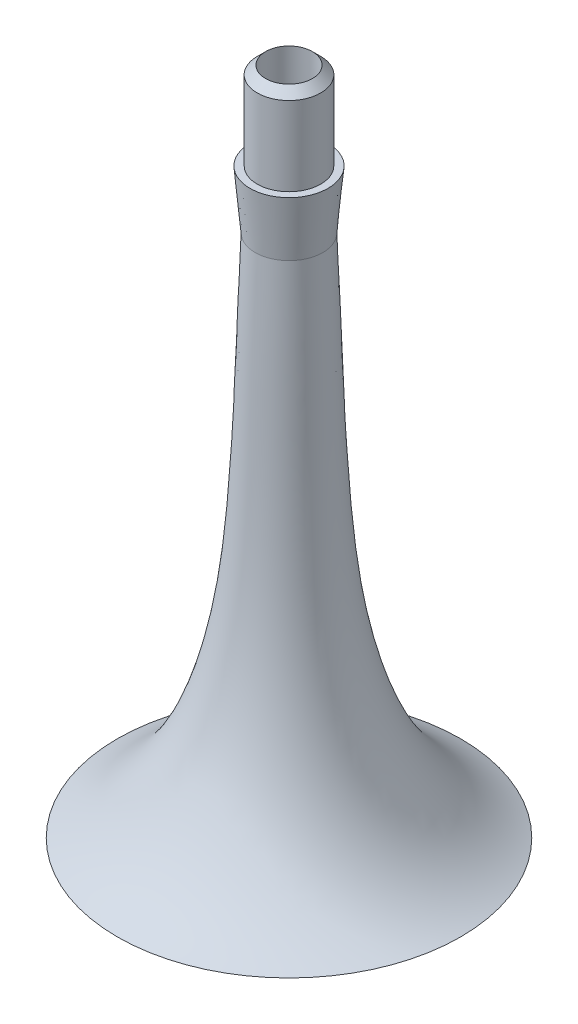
ISO-10303-21;
HEADER;
FILE_DESCRIPTION(('STEP AP214'),'2;1');
FILE_NAME('part.step','',(''),(''),'','','');
FILE_SCHEMA(('AUTOMOTIVE_DESIGN { 1 0 10303 214 1 1 1 1 }'));
ENDSEC;
DATA;
#1=APPLICATION_CONTEXT('core data for automotive mechanical design processes');
#2=APPLICATION_PROTOCOL_DEFINITION('international standard','automotive_design',2000,#1);
#3=PRODUCT_CONTEXT('',#1,'mechanical');
#4=PRODUCT('Part','Part','',(#3));
#5=PRODUCT_RELATED_PRODUCT_CATEGORY('part','',(#4));
#6=PRODUCT_DEFINITION_FORMATION('','',#4);
#7=PRODUCT_DEFINITION_CONTEXT('part definition',#1,'design');
#8=PRODUCT_DEFINITION('design','',#6,#7);
#9=PRODUCT_DEFINITION_SHAPE('','',#8);
#10=(LENGTH_UNIT() NAMED_UNIT(*) SI_UNIT(.MILLI.,.METRE.));
#11=(NAMED_UNIT(*) PLANE_ANGLE_UNIT() SI_UNIT($,.RADIAN.));
#12=(NAMED_UNIT(*) SI_UNIT($,.STERADIAN.) SOLID_ANGLE_UNIT());
#13=UNCERTAINTY_MEASURE_WITH_UNIT(LENGTH_MEASURE(1.E-05),#10,'distance_accuracy_value','');
#14=(GEOMETRIC_REPRESENTATION_CONTEXT(3) GLOBAL_UNCERTAINTY_ASSIGNED_CONTEXT((#13)) GLOBAL_UNIT_ASSIGNED_CONTEXT((#10,
#11,#12)) REPRESENTATION_CONTEXT('',''));
#15=CARTESIAN_POINT('',(0.,0.,0.));
#16=DIRECTION('',(0.,0.,1.));
#17=DIRECTION('',(1.,0.,0.));
#18=AXIS2_PLACEMENT_3D('',#15,#16,#17);
#19=CARTESIAN_POINT('',(0.,0.,0.));
#20=DIRECTION('',(0.,-1.,0.));
#21=DIRECTION('',(0.,0.,-1.));
#22=AXIS2_PLACEMENT_3D('',#19,#20,#21);
#23=CYLINDRICAL_SURFACE('',#22,10.9);
#24=CARTESIAN_POINT('',(0.,200.,0.));
#25=DIRECTION('',(0.,-1.,0.));
#26=DIRECTION('',(0.,0.,-1.));
#27=AXIS2_PLACEMENT_3D('',#24,#25,#26);
#28=CIRCLE('',#27,10.9);
#29=CARTESIAN_POINT('',(0.,200.,-10.9));
#30=VERTEX_POINT('',#29);
#31=EDGE_CURVE('E49',#30,#30,#28,.T.);
#32=ORIENTED_EDGE('',*,*,#31,.F.);
#33=EDGE_LOOP('',(#32));
#34=FACE_BOUND('',#33,.T.);
#35=CARTESIAN_POINT('',(0.,227.139701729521,0.));
#36=DIRECTION('',(0.,1.,0.));
#37=DIRECTION('',(0.,0.,1.));
#38=AXIS2_PLACEMENT_3D('',#35,#36,#37);
#39=CIRCLE('',#38,10.9);
#40=CARTESIAN_POINT('',(0.,227.139701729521,10.9));
#41=VERTEX_POINT('',#40);
#42=EDGE_CURVE('E89',#41,#41,#39,.T.);
#43=ORIENTED_EDGE('',*,*,#42,.F.);
#44=EDGE_LOOP('',(#43));
#45=FACE_BOUND('',#44,.T.);
#46=ADVANCED_FACE('F33',(#34,#45),#23,.T.);
#47=CARTESIAN_POINT('',(-9.75,250.,0.));
#48=CARTESIAN_POINT('',(-9.98555641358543,216.641323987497,0.));
#49=CARTESIAN_POINT('',(-12.3807626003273,166.66644896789,0.));
#50=CARTESIAN_POINT('',(-14.2935109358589,99.7849088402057,0.));
#51=CARTESIAN_POINT('',(-20.5430688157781,45.3749045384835,0.));
#52=CARTESIAN_POINT('',(-38.5109567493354,9.68948562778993,0.));
#53=CARTESIAN_POINT('',(-59.,0.,0.));
#54=B_SPLINE_CURVE_WITH_KNOTS('',3,(#47,#48,#49,#50,#51,#52,#53),.UNSPECIFIED.,.F.,.F.,(4,1,1,1,
4),(0.,0.379010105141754,0.568616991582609,0.760294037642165,1.),.UNSPECIFIED.);
#55=CARTESIAN_POINT('',(0.,100.,0.));
#56=DIRECTION('',(0.,-1.,0.));
#57=AXIS1_PLACEMENT('',#55,#56);
#58=SURFACE_OF_REVOLUTION('',#54,#57);
#59=CARTESIAN_POINT('',(0.,0.,0.));
#60=DIRECTION('',(0.,-1.,0.));
#61=DIRECTION('',(0.,0.,-1.));
#62=AXIS2_PLACEMENT_3D('',#59,#60,#61);
#63=CIRCLE('',#62,59.);
#64=CARTESIAN_POINT('',(0.,0.,-59.));
#65=VERTEX_POINT('',#64);
#66=EDGE_CURVE('E44',#65,#65,#63,.T.);
#67=ORIENTED_EDGE('',*,*,#66,.F.);
#68=EDGE_LOOP('',(#67));
#69=FACE_BOUND('',#68,.T.);
#70=CARTESIAN_POINT('',(0.,179.99995883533,0.));
#71=DIRECTION('',(0.,-1.,0.));
#72=DIRECTION('',(0.,0.,-1.));
#73=AXIS2_PLACEMENT_3D('',#70,#71,#72);
#74=CIRCLE('',#73,11.6312410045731);
#75=CARTESIAN_POINT('',(0.,179.99995883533,-11.6312410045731));
#76=VERTEX_POINT('',#75);
#77=EDGE_CURVE('E10',#76,#76,#74,.F.);
#78=ORIENTED_EDGE('',*,*,#77,.F.);
#79=EDGE_LOOP('',(#78));
#80=FACE_BOUND('',#79,.T.);
#81=ADVANCED_FACE('F35',(#69,#80),#58,.T.);
#82=CARTESIAN_POINT('',(-7.76566446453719,248.,0.));
#83=CARTESIAN_POINT('',(-7.95374430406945,226.275140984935,0.));
#84=CARTESIAN_POINT('',(-8.7034862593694,204.566077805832,0.));
#85=CARTESIAN_POINT('',(-9.93078774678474,172.005370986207,0.));
#86=CARTESIAN_POINT('',(-10.3569484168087,161.152402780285,0.));
#87=CARTESIAN_POINT('',(-11.119704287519,139.442842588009,0.));
#88=CARTESIAN_POINT('',(-11.4532480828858,128.58607890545,0.));
#89=CARTESIAN_POINT('',(-12.2199048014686,112.311978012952,0.));
#90=CARTESIAN_POINT('',(-12.5199094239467,106.887981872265,0.));
#91=CARTESIAN_POINT('',(-13.2644449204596,96.0507324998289,0.));
#92=CARTESIAN_POINT('',(-13.705490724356,90.6464433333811,0.));
#93=CARTESIAN_POINT('',(-15.4201647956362,74.5151844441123,0.));
#94=CARTESIAN_POINT('',(-17.0891337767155,63.8706162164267,0.));
#95=CARTESIAN_POINT('',(-20.4234700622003,50.8250546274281,0.));
#96=CARTESIAN_POINT('',(-21.1513562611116,48.2286605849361,0.));
#97=CARTESIAN_POINT('',(-22.7525870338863,43.0661906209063,0.));
#98=CARTESIAN_POINT('',(-23.626880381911,40.5003124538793,0.));
#99=CARTESIAN_POINT('',(-25.5624806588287,35.4075356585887,0.));
#100=CARTESIAN_POINT('',(-26.6235630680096,32.8805902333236,0.));
#101=CARTESIAN_POINT('',(-28.9846855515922,27.8765057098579,0.));
#102=CARTESIAN_POINT('',(-30.2669737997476,25.4382928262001,0.));
#103=CARTESIAN_POINT('',(-33.0665457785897,20.7180978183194,0.));
#104=CARTESIAN_POINT('',(-34.584212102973,18.4350481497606,0.));
#105=CARTESIAN_POINT('',(-37.0684011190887,15.1462217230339,0.));
#106=CARTESIAN_POINT('',(-37.9311397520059,14.0726106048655,0.));
#107=CARTESIAN_POINT('',(-39.7320044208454,11.9746623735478,0.));
#108=CARTESIAN_POINT('',(-40.6721436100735,10.9487936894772,0.));
#109=CARTESIAN_POINT('',(-45.5012893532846,6.02693762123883,0.));
#110=CARTESIAN_POINT('',(-49.8243650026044,2.69268936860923,0.));
#111=CARTESIAN_POINT('',(-54.6364071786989,0.,0.));
#112=B_SPLINE_CURVE_WITH_KNOTS('',3,(#82,#83,#84,#85,#86,#87,#88,#89,#90,#91,#92,#93,#94,#95,
#96,#97,#98,#99,#100,#101,#102,#103,#104,#105,#106,#107,#108,#109,#110,#111),.UNSPECIFIED.,.F.,
.F.,(4,2,2,2,2,2,2,2,2,2,2,2,2,2,4),(0.,0.25,0.375,0.5,0.5625,0.625,0.75,0.78125,0.8125,0.84375,
0.875,0.90625,0.921875,0.9375,1.),.UNSPECIFIED.);
#113=CARTESIAN_POINT('',(0.,100.,0.));
#114=DIRECTION('',(0.,-1.,0.));
#115=AXIS1_PLACEMENT('',#113,#114);
#116=SURFACE_OF_REVOLUTION('',#112,#115);
#117=CARTESIAN_POINT('',(0.,229.99999999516,0.));
#118=DIRECTION('',(0.,1.,0.));
#119=DIRECTION('',(0.,0.,1.));
#120=AXIS2_PLACEMENT_3D('',#117,#118,#119);
#121=CIRCLE('',#120,8.03970173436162);
#122=CARTESIAN_POINT('',(0.,229.99999999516,8.03970173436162));
#123=VERTEX_POINT('',#122);
#124=EDGE_CURVE('E92',#123,#123,#121,.T.);
#125=ORIENTED_EDGE('',*,*,#124,.T.);
#126=EDGE_LOOP('',(#125));
#127=FACE_BOUND('',#126,.T.);
#128=CARTESIAN_POINT('',(0.,0.,0.));
#129=DIRECTION('',(0.,-1.,0.));
#130=DIRECTION('',(0.,0.,-1.));
#131=AXIS2_PLACEMENT_3D('',#128,#129,#130);
#132=CIRCLE('',#131,54.6364071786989);
#133=CARTESIAN_POINT('',(0.,0.,-54.6364071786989));
#134=VERTEX_POINT('',#133);
#135=EDGE_CURVE('E40',#134,#134,#132,.T.);
#136=ORIENTED_EDGE('',*,*,#135,.T.);
#137=EDGE_LOOP('',(#136));
#138=FACE_BOUND('',#137,.T.);
#139=ADVANCED_FACE('F62',(#127,#138),#116,.F.);
#140=CARTESIAN_POINT('',(-59.,0.,0.));
#141=DIRECTION('',(0.,-1.,0.));
#142=DIRECTION('',(0.,0.,-1.));
#143=AXIS2_PLACEMENT_3D('',#140,#141,#142);
#144=PLANE('',#143);
#145=ORIENTED_EDGE('',*,*,#66,.T.);
#146=EDGE_LOOP('',(#145));
#147=FACE_BOUND('',#146,.T.);
#148=ORIENTED_EDGE('',*,*,#135,.F.);
#149=EDGE_LOOP('',(#148));
#150=FACE_BOUND('',#149,.T.);
#151=ADVANCED_FACE('F65',(#147,#150),#144,.T.);
#152=CARTESIAN_POINT('',(0.,200.,0.));
#153=DIRECTION('',(0.,1.,0.));
#154=DIRECTION('',(0.,0.,1.));
#155=AXIS2_PLACEMENT_3D('',#152,#153,#154);
#156=CONICAL_SURFACE('',#155,13.4,0.0882082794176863);
#157=ORIENTED_EDGE('',*,*,#77,.T.);
#158=EDGE_LOOP('',(#157));
#159=FACE_BOUND('',#158,.T.);
#160=CARTESIAN_POINT('',(0.,200.,0.));
#161=DIRECTION('',(0.,-1.,0.));
#162=DIRECTION('',(0.,0.,-1.));
#163=AXIS2_PLACEMENT_3D('',#160,#161,#162);
#164=CIRCLE('',#163,13.4);
#165=CARTESIAN_POINT('',(0.,200.,-13.4));
#166=VERTEX_POINT('',#165);
#167=EDGE_CURVE('E94',#166,#166,#164,.T.);
#168=ORIENTED_EDGE('',*,*,#167,.T.);
#169=EDGE_LOOP('',(#168));
#170=FACE_BOUND('',#169,.T.);
#171=ADVANCED_FACE('F69',(#159,#170),#156,.T.);
#172=CARTESIAN_POINT('',(0.,200.,0.));
#173=DIRECTION('',(0.,-1.,0.));
#174=DIRECTION('',(0.,0.,-1.));
#175=AXIS2_PLACEMENT_3D('',#172,#173,#174);
#176=PLANE('',#175);
#177=ORIENTED_EDGE('',*,*,#167,.F.);
#178=EDGE_LOOP('',(#177));
#179=FACE_BOUND('',#178,.T.);
#180=ORIENTED_EDGE('',*,*,#31,.T.);
#181=EDGE_LOOP('',(#180));
#182=FACE_BOUND('',#181,.T.);
#183=ADVANCED_FACE('F74',(#179,#182),#176,.F.);
#184=CARTESIAN_POINT('',(0.,229.99999999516,0.));
#185=DIRECTION('',(0.,-1.,0.));
#186=DIRECTION('',(0.,0.,-1.));
#187=AXIS2_PLACEMENT_3D('',#184,#185,#186);
#188=CONICAL_SURFACE('',#187,8.03970173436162,0.785398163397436);
#189=ORIENTED_EDGE('',*,*,#42,.T.);
#190=EDGE_LOOP('',(#189));
#191=FACE_BOUND('',#190,.T.);
#192=ORIENTED_EDGE('',*,*,#124,.F.);
#193=EDGE_LOOP('',(#192));
#194=FACE_BOUND('',#193,.T.);
#195=ADVANCED_FACE('F77',(#191,#194),#188,.T.);
#196=CLOSED_SHELL('',(#46,#81,#139,#151,#171,#183,#195));
#197=MANIFOLD_SOLID_BREP('B2',#196);
#198=ADVANCED_BREP_SHAPE_REPRESENTATION('',(#18,#197),#14);
#199=SHAPE_DEFINITION_REPRESENTATION(#9,#198);
ENDSEC;
END-ISO-10303-21;
